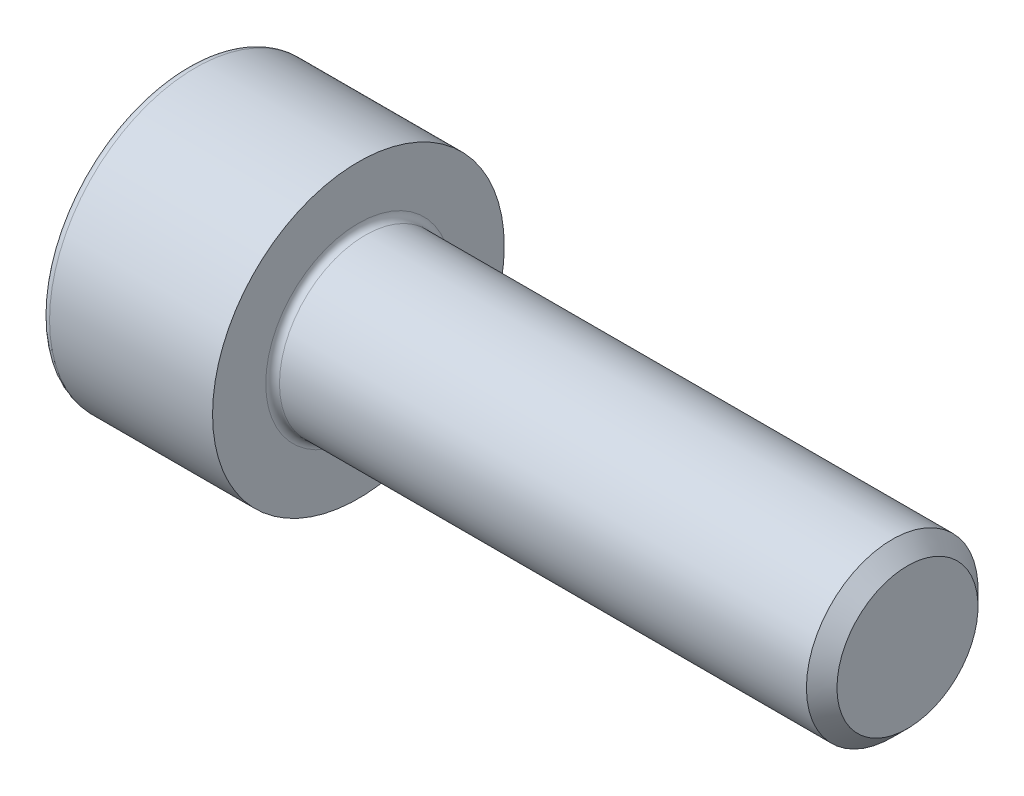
from build123d import *

# Parameters (mm, degrees)
FILLET1_R   = 0.2
FILLET2_R   = 0.25
HEX_2_DEPTH = 2.5


with BuildPart() as part:
    # BodySke → Base-Revolve (revolve)
    with BuildSketch(Plane.XY, mode=Mode.PRIVATE) as base_revolve_sk:
        Polygon((0, 0), (0, 4.25), (5, 4.25), (5, 2.5), (20.555, 2.5), (21, 2.055), (21, 0), align=None)
    revolve(base_revolve_sk.sketch.rotate(Axis((-31.75, 0, 0), (1, 0, 0)), 90), axis=Axis((-31.75, 0, 0), (1, 0, 0)))

    # Fillet1
    fillet1_edges = [part.edges().sort_by_distance(p)[0] for p in [
        (5, 0, -2.5),
    ]]
    fillet(fillet1_edges, radius=FILLET1_R)

    # Fillet2
    fillet2_edges = [part.edges().sort_by_distance(p)[0] for p in [
        (0, 0, -4.25),
    ]]
    fillet(fillet2_edges, radius=FILLET2_R)

    # Sketch2 → Hex-PreBroach (revolve, cut)
    with BuildSketch(Plane.XY, mode=Mode.PRIVATE) as hex_prebroach_sk:
        Polygon((0, 2.042), (2.5, 2.042), (3.67894925, 0), (0, 0), align=None)
    revolve(hex_prebroach_sk.sketch.rotate(Axis((0, 0, 0), (1, 0, 0)), 90), axis=Axis((0, 0, 0), (1, 0, 0)), mode=Mode.SUBTRACT)

    # Sketch3 → Hex 2 (cut)
    with BuildSketch(Plane(origin=(0, 0, 0), x_dir=(0, 0.500000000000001, 0.866025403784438), z_dir=(-1, 0, 0))):
        Polygon((1.17894925, 2.042), (-1.17894925, 2.042), (-2.357898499, 0), (-1.17894925, -2.042), (1.17894925, -2.042), (2.357898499, 0), align=None)
    extrude(amount=-HEX_2_DEPTH, mode=Mode.SUBTRACT)


solid = part.part
